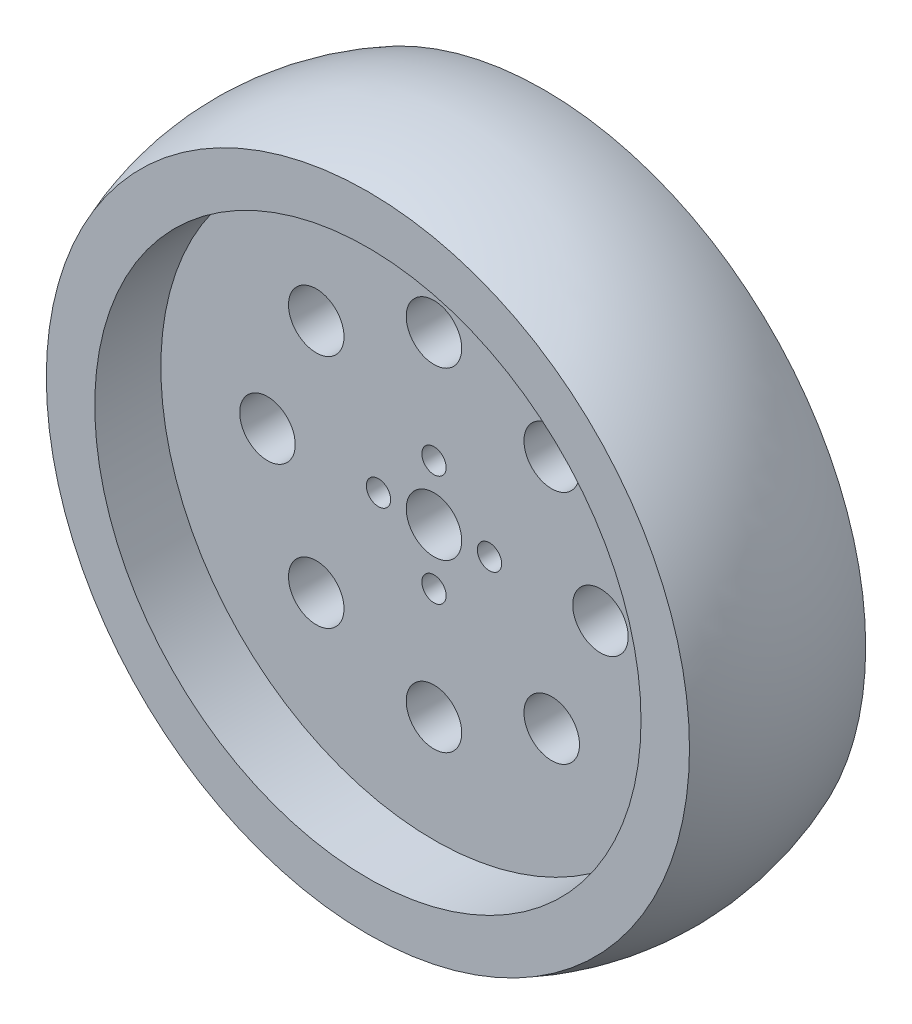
from build123d import *

# Parameters (mm, degrees)
SKETCH1_R          = 44.45
EXTRUDE1_DEPTH     = 21.082
SKETCH2_R          = 39.37
CUT_EXTRUDE1_DEPTH = 7.366
CUT_EXTRUDE2_START = -7.366
SKETCH3_R          = 39.37
CUT_EXTRUDE2_DEPTH = 7.366
SKETCH4_R          = 46.355
EXTRUDE2_DEPTH     = 2.159
EXTRUDE3_START     = 2.159
SKETCH5_R          = 46.355
EXTRUDE3_DEPTH     = 2.159
CUT_EXTRUDE3_REACH = 72.305
SKETCH6_R          = 39.37
CUT_EXTRUDE4_REACH = 72.305
SKETCH7_R          = 39.37
SKETCH8_R          = 4
SKETCH8_R_2        = 1.75
CUT_EXTRUDE5_DEPTH = 71.8144581
SKETCH9_R          = 4
CUT_EXTRUDE6_DEPTH = 71.8144581


with BuildPart() as part:
    # Sketch1 → Extrude1 (new body)
    with BuildSketch(Plane.XY):
        Circle(SKETCH1_R)
    extrude(amount=-EXTRUDE1_DEPTH)

    # Sketch2 → Cut-Extrude1 (cut)
    with BuildSketch(Plane.XY):
        Circle(SKETCH2_R)
    extrude(amount=-CUT_EXTRUDE1_DEPTH, mode=Mode.SUBTRACT)

    # Sketch3 → Cut-Extrude2 (cut)
    with BuildSketch(Plane(origin=(0, 0, -21.082), x_dir=(-1, 0, 0), z_dir=(0, 0, -1)).offset(CUT_EXTRUDE2_START)):
        with Locations(Location((0, 0, 0), (0, 0, 180))):
            Circle(SKETCH3_R)
    extrude(amount=CUT_EXTRUDE2_DEPTH, mode=Mode.SUBTRACT)

    # Sketch4 → Extrude2 (add)
    with BuildSketch(Plane.XY):
        Circle(SKETCH4_R)
    extrude(amount=EXTRUDE2_DEPTH)

    # Sketch5 → Extrude3 (add)
    with BuildSketch(Plane(origin=(0, 0, -21.082), x_dir=(-1, 0, 0), z_dir=(0, 0, -1)).offset(EXTRUDE3_START)):
        with Locations(Location((0, 0, 0), (0, 0, 180))):
            Circle(SKETCH5_R)
    extrude(amount=-EXTRUDE3_DEPTH)

    # Sketch6 → Cut-Extrude3 (cut, up to next)
    with BuildSketch(Plane.XY.offset(2.159), mode=Mode.PRIVATE) as cut_extrude3_sk1:
        Circle(SKETCH6_R)
    cut_extrude3_tool1 = extrude(cut_extrude3_sk1.sketch, amount=-CUT_EXTRUDE3_REACH, mode=Mode.PRIVATE) & part.part
    add(cut_extrude3_tool1.solids().sort_by_distance((0, 0, 2.159))[0], mode=Mode.SUBTRACT)

    # Sketch7 → Cut-Extrude4 (cut, up to next)
    with BuildSketch(Plane(origin=(0, 0, -23.241), x_dir=(-1, 0, 0), z_dir=(0, 0, -1)), mode=Mode.PRIVATE) as cut_extrude4_sk1:
        with Locations(Location((0, 0, 0), (0, 0, 180))):
            Circle(SKETCH7_R)
    cut_extrude4_tool1 = extrude(cut_extrude4_sk1.sketch, amount=-CUT_EXTRUDE4_REACH, mode=Mode.PRIVATE) & part.part
    add(cut_extrude4_tool1.solids().sort_by_distance((0, 0, -23.241))[0], mode=Mode.SUBTRACT)

    # Sweep1: sweep along a curve in space
    with BuildLine() as sweep1_path:
        ThreePointArc((46.355, 0, 2.159), (32.777934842, 32.777934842, 2.159), (0, 46.355, 2.159))
        ThreePointArc((0, 46.355, 2.159), (-32.777934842, 32.777934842, 2.159), (-46.355, 0, 2.159))
        ThreePointArc((-46.355, 0, 2.159), (-32.777934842, -32.777934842, 2.159), (0, -46.355, 2.159))
        ThreePointArc((0, -46.355, 2.159), (32.777934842, -32.777934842, 2.159), (46.355, 0, 2.159))
    # 3DSketch1 → Sweep1 (sweep)
    with BuildSketch(Plane(origin=(0, 46.355, 2.159), x_dir=(-1.2447025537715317e-13, -0.9285817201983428, -0.3711279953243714), z_dir=(1, 0, 0))):
        with BuildLine():
            Line((0, 0), (0.801265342, 2.004807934))
            Line((0.801265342, 2.004807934), (2.565756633, 1.299590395))
            Line((2.565756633, 1.299590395), (10.394333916, 20.874168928))
            Line((10.394333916, 20.874168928), (8.625385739, 21.581167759))
            Line((8.625385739, 21.581167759), (9.426651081, 23.585975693))
            ThreePointArc((9.426651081, 23.585975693), (2.443933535, 12.7), (0, 0))
        make_face()
    sweep(path=sweep1_path.line)

    # Sketch8 → Cut-Extrude5 (cut, through all)
    with BuildSketch(Plane.XY.offset(-7.366)):
        Circle(SKETCH8_R)
        with Locations((0, 8)):
            Circle(SKETCH8_R_2)
        with Locations((8, 0)):
            Circle(SKETCH8_R_2)
        with Locations((0, -8)):
            Circle(SKETCH8_R_2)
        with Locations((-8, 0)):
            Circle(SKETCH8_R_2)
    extrude(amount=-CUT_EXTRUDE5_DEPTH, mode=Mode.SUBTRACT)

    # Sketch9 → Cut-Extrude6 (cut, through all)
    with BuildSketch(Plane.XY.offset(-7.366)):
        with Locations((0, 24)):
            Circle(SKETCH9_R)
        with Locations((24, 0)):
            Circle(SKETCH9_R)
        with Locations((0, -24)):
            Circle(SKETCH9_R)
        with Locations((-24, 0)):
            Circle(SKETCH9_R)
        with Locations((16.970562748, 16.970562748)):
            Circle(SKETCH9_R)
        with Locations((16.970562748, -16.970562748)):
            Circle(SKETCH9_R)
        with Locations((-16.970562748, -16.970562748)):
            Circle(SKETCH9_R)
        with Locations((-16.970562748, 16.970562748)):
            Circle(SKETCH9_R)
    extrude(amount=-CUT_EXTRUDE6_DEPTH, mode=Mode.SUBTRACT)


solid = part.part
